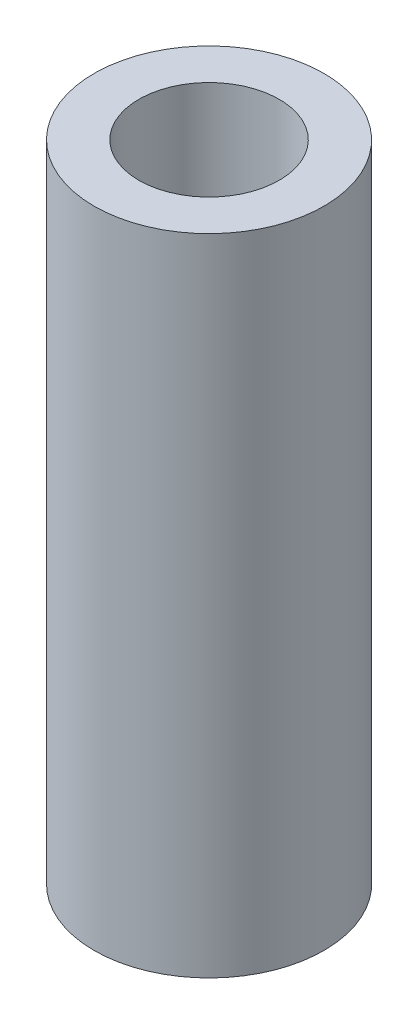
ISO-10303-21;
HEADER;
FILE_DESCRIPTION(('STEP AP214'),'2;1');
FILE_NAME('part.step','',(''),(''),'','','');
FILE_SCHEMA(('AUTOMOTIVE_DESIGN { 1 0 10303 214 1 1 1 1 }'));
ENDSEC;
DATA;
#1=APPLICATION_CONTEXT('core data for automotive mechanical design processes');
#2=APPLICATION_PROTOCOL_DEFINITION('international standard','automotive_design',2000,#1);
#3=PRODUCT_CONTEXT('',#1,'mechanical');
#4=PRODUCT('Part','Part','',(#3));
#5=PRODUCT_RELATED_PRODUCT_CATEGORY('part','',(#4));
#6=PRODUCT_DEFINITION_FORMATION('','',#4);
#7=PRODUCT_DEFINITION_CONTEXT('part definition',#1,'design');
#8=PRODUCT_DEFINITION('design','',#6,#7);
#9=PRODUCT_DEFINITION_SHAPE('','',#8);
#10=(LENGTH_UNIT() NAMED_UNIT(*) SI_UNIT(.MILLI.,.METRE.));
#11=(NAMED_UNIT(*) PLANE_ANGLE_UNIT() SI_UNIT($,.RADIAN.));
#12=(NAMED_UNIT(*) SI_UNIT($,.STERADIAN.) SOLID_ANGLE_UNIT());
#13=UNCERTAINTY_MEASURE_WITH_UNIT(LENGTH_MEASURE(1.E-05),#10,'distance_accuracy_value','');
#14=(GEOMETRIC_REPRESENTATION_CONTEXT(3) GLOBAL_UNCERTAINTY_ASSIGNED_CONTEXT((#13)) GLOBAL_UNIT_ASSIGNED_CONTEXT((#10,
#11,#12)) REPRESENTATION_CONTEXT('',''));
#15=CARTESIAN_POINT('',(0.,0.,0.));
#16=DIRECTION('',(0.,0.,1.));
#17=DIRECTION('',(1.,0.,0.));
#18=AXIS2_PLACEMENT_3D('',#15,#16,#17);
#19=CARTESIAN_POINT('',(0.,11.43,0.));
#20=DIRECTION('',(0.,1.,0.));
#21=DIRECTION('',(0.,0.,1.));
#22=AXIS2_PLACEMENT_3D('',#19,#20,#21);
#23=PLANE('',#22);
#24=CARTESIAN_POINT('',(0.,11.43,0.));
#25=DIRECTION('',(0.,1.,0.));
#26=DIRECTION('',(0.,0.,1.));
#27=AXIS2_PLACEMENT_3D('',#24,#25,#26);
#28=CIRCLE('',#27,4.0767);
#29=CARTESIAN_POINT('',(0.,11.43,4.0767));
#30=VERTEX_POINT('',#29);
#31=EDGE_CURVE('E10',#30,#30,#28,.T.);
#32=ORIENTED_EDGE('',*,*,#31,.T.);
#33=EDGE_LOOP('',(#32));
#34=FACE_BOUND('',#33,.T.);
#35=CARTESIAN_POINT('',(0.,11.43,0.));
#36=DIRECTION('',(0.,1.,0.));
#37=DIRECTION('',(0.,0.,1.));
#38=AXIS2_PLACEMENT_3D('',#35,#36,#37);
#39=CIRCLE('',#38,2.4892);
#40=CARTESIAN_POINT('',(0.,11.43,2.4892));
#41=VERTEX_POINT('',#40);
#42=EDGE_CURVE('E45',#41,#41,#39,.T.);
#43=ORIENTED_EDGE('',*,*,#42,.F.);
#44=EDGE_LOOP('',(#43));
#45=FACE_BOUND('',#44,.T.);
#46=ADVANCED_FACE('F34',(#34,#45),#23,.T.);
#47=CARTESIAN_POINT('',(0.,-11.43,0.));
#48=DIRECTION('',(0.,1.,0.));
#49=DIRECTION('',(0.,0.,1.));
#50=AXIS2_PLACEMENT_3D('',#47,#48,#49);
#51=PLANE('',#50);
#52=CARTESIAN_POINT('',(0.,-11.43,0.));
#53=DIRECTION('',(0.,1.,0.));
#54=DIRECTION('',(0.,0.,1.));
#55=AXIS2_PLACEMENT_3D('',#52,#53,#54);
#56=CIRCLE('',#55,4.0767);
#57=CARTESIAN_POINT('',(0.,-11.43,4.0767));
#58=VERTEX_POINT('',#57);
#59=EDGE_CURVE('E38',#58,#58,#56,.T.);
#60=ORIENTED_EDGE('',*,*,#59,.F.);
#61=EDGE_LOOP('',(#60));
#62=FACE_BOUND('',#61,.T.);
#63=CARTESIAN_POINT('',(0.,-11.43,0.));
#64=DIRECTION('',(0.,1.,0.));
#65=DIRECTION('',(0.,0.,1.));
#66=AXIS2_PLACEMENT_3D('',#63,#64,#65);
#67=CIRCLE('',#66,2.4892);
#68=CARTESIAN_POINT('',(0.,-11.43,2.4892));
#69=VERTEX_POINT('',#68);
#70=EDGE_CURVE('E47',#69,#69,#67,.T.);
#71=ORIENTED_EDGE('',*,*,#70,.T.);
#72=EDGE_LOOP('',(#71));
#73=FACE_BOUND('',#72,.T.);
#74=ADVANCED_FACE('F57',(#62,#73),#51,.F.);
#75=CARTESIAN_POINT('',(0.,11.43,0.));
#76=DIRECTION('',(0.,-1.,0.));
#77=DIRECTION('',(0.,0.,-1.));
#78=AXIS2_PLACEMENT_3D('',#75,#76,#77);
#79=CYLINDRICAL_SURFACE('',#78,4.0767);
#80=ORIENTED_EDGE('',*,*,#31,.F.);
#81=EDGE_LOOP('',(#80));
#82=FACE_BOUND('',#81,.T.);
#83=ORIENTED_EDGE('',*,*,#59,.T.);
#84=EDGE_LOOP('',(#83));
#85=FACE_BOUND('',#84,.T.);
#86=ADVANCED_FACE('F36',(#82,#85),#79,.T.);
#87=CARTESIAN_POINT('',(0.,11.43,0.));
#88=DIRECTION('',(0.,-1.,0.));
#89=DIRECTION('',(0.,0.,-1.));
#90=AXIS2_PLACEMENT_3D('',#87,#88,#89);
#91=CYLINDRICAL_SURFACE('',#90,2.4892);
#92=ORIENTED_EDGE('',*,*,#42,.T.);
#93=EDGE_LOOP('',(#92));
#94=FACE_BOUND('',#93,.T.);
#95=ORIENTED_EDGE('',*,*,#70,.F.);
#96=EDGE_LOOP('',(#95));
#97=FACE_BOUND('',#96,.T.);
#98=ADVANCED_FACE('F53',(#94,#97),#91,.F.);
#99=CLOSED_SHELL('',(#46,#74,#86,#98));
#100=MANIFOLD_SOLID_BREP('B2',#99);
#101=ADVANCED_BREP_SHAPE_REPRESENTATION('',(#18,#100),#14);
#102=SHAPE_DEFINITION_REPRESENTATION(#9,#101);
ENDSEC;
END-ISO-10303-21;
